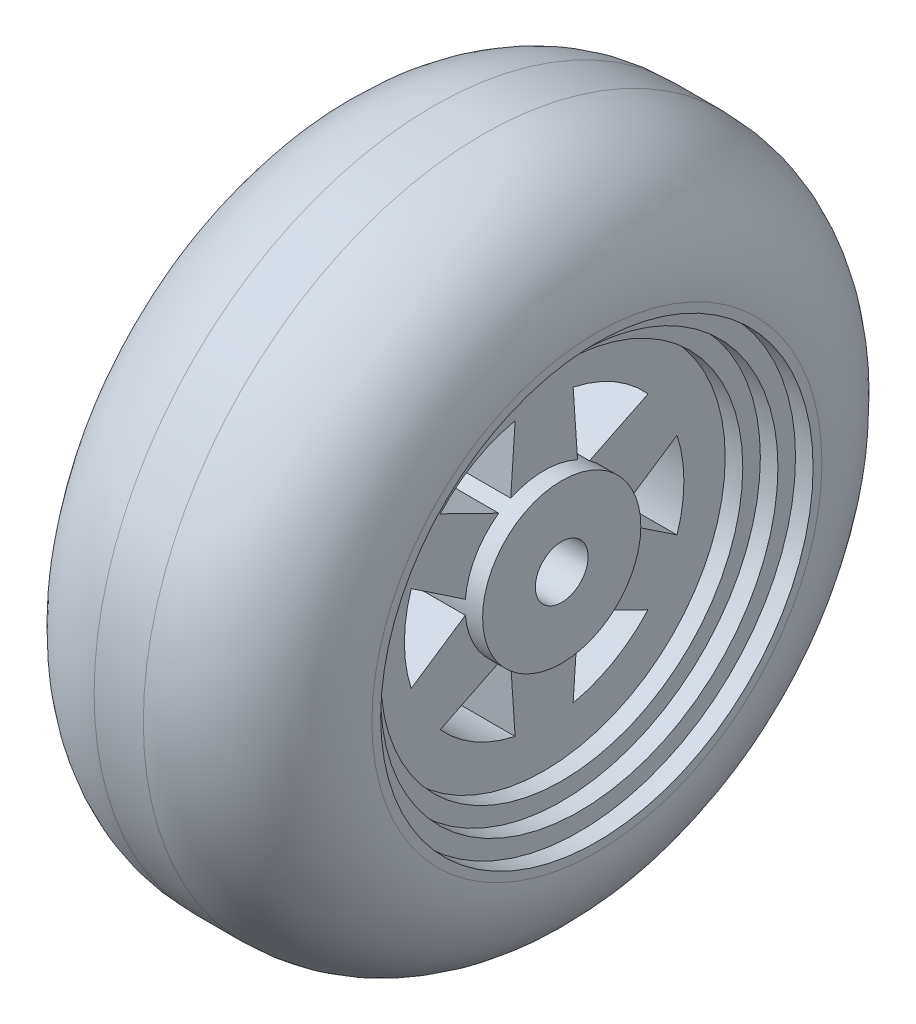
from build123d import *
from build123d.topology import SkipClean

# Parameters (mm, degrees)
ESQUISSE1_R             = 19.3
EXTRUSION1_DEPTH        = 15.8
ESQUISSE2_R             = 12.3
ENL_V_MAT_EXTRU_1_DEPTH = 1
ESQUISSE3_R             = 11.3
ENL_V_MAT_EXTRU_2_DEPTH = 1
ESQUISSE4_R             = 10.3
ENL_V_MAT_EXTRU_3_DEPTH = 1
ENL_V_START             = -1
ESQUISSE6_R             = 12.3
ENL_V_MAT_EXTRU_4_DEPTH = 1
EXTRUSION3_START        = 5
ESQUISSE7_R             = 4.5
EXTRUSION3_DEPTH        = 5
ESQUISSE8_R             = 4.5
EXTRUSION4_DEPTH        = 1
ESQUISSE9_R             = 1.5
ENL_V_MAT_EXTRU_5_DEPTH = 33.585579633
CONG_1_R                = 6.5


with BuildPart() as part:
    # Esquisse1 → Extrusion1 (new body)
    with BuildSketch(Plane(origin=(0, 0, 0), x_dir=(0, 0, -1), z_dir=(1, 0, 0))):
        Circle(ESQUISSE1_R)
        with BuildLine():
            Line((1.9, 4.079215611), (1.65, 7.776888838))
            ThreePointArc((1.65, 7.776888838), (3.975, 6.88490196), (5.909983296, 5.317386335))
            Line((5.909983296, 5.317386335), (2.582704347, 3.685056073))
            ThreePointArc((2.582704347, 3.685056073), (2.25, 3.897114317), (1.9, 4.079215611))
        make_face(mode=Mode.SUBTRACT)
        with BuildLine():
            Line((-1.9, 4.079215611), (-1.65, 7.776888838))
            ThreePointArc((-1.65, 7.776888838), (-3.975, 6.88490196), (-5.909983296, 5.317386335))
            Line((-5.909983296, 5.317386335), (-2.582704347, 3.685056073))
            ThreePointArc((-2.582704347, 3.685056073), (-2.25, 3.897114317), (-1.9, 4.079215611))
        make_face(mode=Mode.SUBTRACT)
        with BuildLine():
            Line((4.482704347, 0.394159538), (7.559983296, 2.459502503))
            ThreePointArc((7.559983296, 2.459502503), (7.95, 0), (7.559983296, -2.459502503))
            Line((7.559983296, -2.459502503), (4.482704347, -0.394159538))
            ThreePointArc((4.482704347, -0.394159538), (4.5, 0), (4.482704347, 0.394159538))
        make_face(mode=Mode.SUBTRACT)
        with BuildLine():
            Line((2.582704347, -3.685056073), (5.909983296, -5.317386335))
            ThreePointArc((5.909983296, -5.317386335), (3.975, -6.88490196), (1.65, -7.776888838))
            Line((1.65, -7.776888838), (1.9, -4.079215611))
            ThreePointArc((1.9, -4.079215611), (2.25, -3.897114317), (2.582704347, -3.685056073))
        make_face(mode=Mode.SUBTRACT)
        with BuildLine():
            Line((-1.9, -4.079215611), (-1.65, -7.776888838))
            ThreePointArc((-1.65, -7.776888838), (-3.975, -6.88490196), (-5.909983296, -5.317386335))
            Line((-5.909983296, -5.317386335), (-2.582704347, -3.685056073))
            ThreePointArc((-2.582704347, -3.685056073), (-2.25, -3.897114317), (-1.9, -4.079215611))
        make_face(mode=Mode.SUBTRACT)
        with BuildLine():
            Line((-4.482704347, -0.394159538), (-7.559983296, -2.459502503))
            ThreePointArc((-7.559983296, -2.459502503), (-7.95, 0), (-7.559983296, 2.459502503))
            Line((-7.559983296, 2.459502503), (-4.482704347, 0.394159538))
            ThreePointArc((-4.482704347, 0.394159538), (-4.5, 0), (-4.482704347, -0.394159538))
        make_face(mode=Mode.SUBTRACT)
    extrude(amount=EXTRUSION1_DEPTH)

    # Esquisse2 → Enl_v. mat.-Extru.1 (cut)
    with BuildSketch(Plane(origin=(15.8, 0, 0), x_dir=(0, 0, -1), z_dir=(1, 0, 0))):
        Circle(ESQUISSE2_R)
    extrude(amount=-ENL_V_MAT_EXTRU_1_DEPTH, mode=Mode.SUBTRACT)

    # Esquisse3 → Enl_v. mat.-Extru.2 (cut)
    with BuildSketch(Plane(origin=(14.8, 0, 0), x_dir=(0, 0, -1), z_dir=(1, 0, 0))):
        Circle(ESQUISSE3_R)
    extrude(amount=-ENL_V_MAT_EXTRU_2_DEPTH, mode=Mode.SUBTRACT)

    # Esquisse4 → Enl_v. mat.-Extru.3 (cut)
    with BuildSketch(Plane(origin=(13.8, 0, 0), x_dir=(0, 0, -1), z_dir=(1, 0, 0))):
        Circle(ESQUISSE4_R)
    extrude(amount=-ENL_V_MAT_EXTRU_3_DEPTH, mode=Mode.SUBTRACT)

    # Esquisse6 → Enl_v. mat.-Extru.4 (cut)
    with BuildSketch(Plane.ZY.offset(ENL_V_START)):
        with Locations(Location((0, 0, 0), (0, 0, 180))):
            Circle(ESQUISSE6_R)
    extrude(amount=ENL_V_MAT_EXTRU_4_DEPTH, mode=Mode.SUBTRACT)

    # Esquisse7 → Extrusion3 (add)
    with SkipClean():  # the faces are left unmerged after this step: merging them gives an invalid solid
        with BuildSketch(Plane.ZY.offset(-1).offset(EXTRUSION3_START)):
            Circle(ESQUISSE7_R)
        extrude(amount=-EXTRUSION3_DEPTH)

    # Esquisse8 → Extrusion4 (add)
    with SkipClean():  # the faces are left unmerged after this step: merging them gives an invalid solid
        with BuildSketch(Plane(origin=(12.8, 0, 0), x_dir=(0, 0, -1), z_dir=(1, 0, 0))):
            with Locations(Location((0, 0, 0), (0, 0, 180))):
                Circle(ESQUISSE8_R)
        extrude(amount=EXTRUSION4_DEPTH)

    # Esquisse9 → Enl_v. mat.-Extru.5 (cut, through all)
    with SkipClean():  # the faces are left unmerged after this step: merging them gives an invalid solid
        with BuildSketch(Plane(origin=(13.8, 0, 0), x_dir=(0, 0, -1), z_dir=(1, 0, 0))):
            Circle(ESQUISSE9_R)
        extrude(amount=-ENL_V_MAT_EXTRU_5_DEPTH, mode=Mode.SUBTRACT)

    # Cong_1
    cong_1_edges = [part.edges().sort_by_distance(p)[0] for p in [
        (0, 0, 19.3),
        (15.8, 0, 19.3),
    ]]
    fillet(cong_1_edges, radius=CONG_1_R)


solid = part.part
